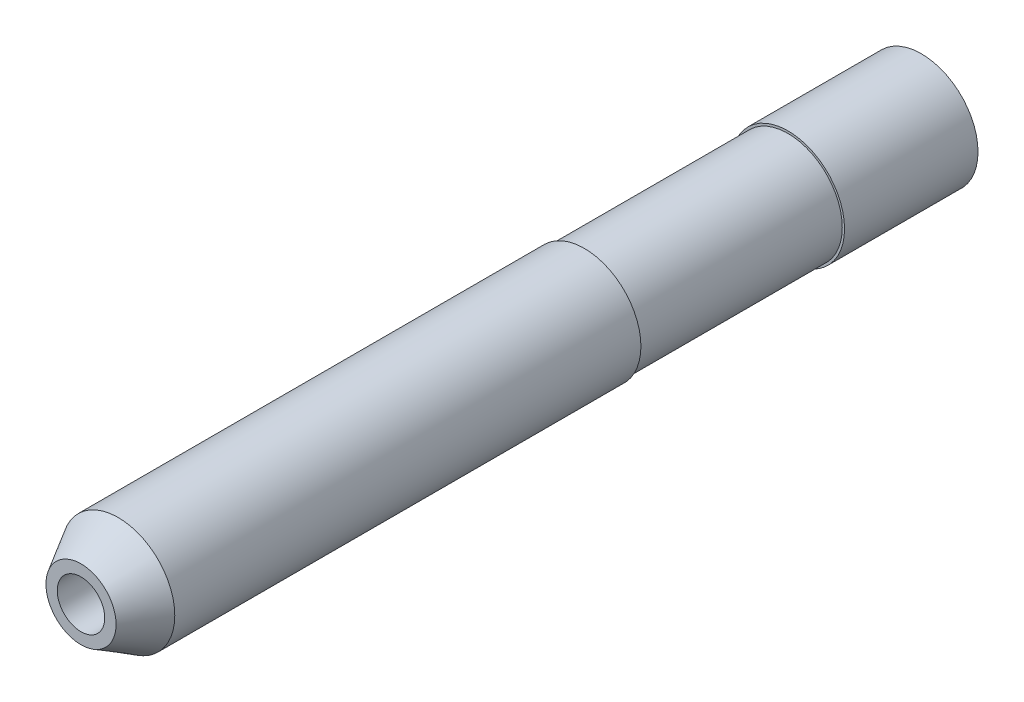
ISO-10303-21;
HEADER;
FILE_DESCRIPTION(('STEP AP214'),'2;1');
FILE_NAME('part.step','',(''),(''),'','','');
FILE_SCHEMA(('AUTOMOTIVE_DESIGN { 1 0 10303 214 1 1 1 1 }'));
ENDSEC;
DATA;
#1=APPLICATION_CONTEXT('core data for automotive mechanical design processes');
#2=APPLICATION_PROTOCOL_DEFINITION('international standard','automotive_design',2000,#1);
#3=PRODUCT_CONTEXT('',#1,'mechanical');
#4=PRODUCT('Part','Part','',(#3));
#5=PRODUCT_RELATED_PRODUCT_CATEGORY('part','',(#4));
#6=PRODUCT_DEFINITION_FORMATION('','',#4);
#7=PRODUCT_DEFINITION_CONTEXT('part definition',#1,'design');
#8=PRODUCT_DEFINITION('design','',#6,#7);
#9=PRODUCT_DEFINITION_SHAPE('','',#8);
#10=(LENGTH_UNIT() NAMED_UNIT(*) SI_UNIT(.MILLI.,.METRE.));
#11=(NAMED_UNIT(*) PLANE_ANGLE_UNIT() SI_UNIT($,.RADIAN.));
#12=(NAMED_UNIT(*) SI_UNIT($,.STERADIAN.) SOLID_ANGLE_UNIT());
#13=UNCERTAINTY_MEASURE_WITH_UNIT(LENGTH_MEASURE(1.E-05),#10,'distance_accuracy_value','');
#14=(GEOMETRIC_REPRESENTATION_CONTEXT(3) GLOBAL_UNCERTAINTY_ASSIGNED_CONTEXT((#13)) GLOBAL_UNIT_ASSIGNED_CONTEXT((#10,
#11,#12)) REPRESENTATION_CONTEXT('',''));
#15=CARTESIAN_POINT('',(0.,0.,0.));
#16=DIRECTION('',(0.,0.,1.));
#17=DIRECTION('',(1.,0.,0.));
#18=AXIS2_PLACEMENT_3D('',#15,#16,#17);
#19=CARTESIAN_POINT('',(1.11022302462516E-13,0.,1351.5));
#20=DIRECTION('',(0.,0.,-1.));
#21=DIRECTION('',(-1.,0.,0.));
#22=AXIS2_PLACEMENT_3D('',#19,#20,#21);
#23=CYLINDRICAL_SURFACE('',#22,25.);
#24=CARTESIAN_POINT('',(0.,-1.11022302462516E-13,980.));
#25=DIRECTION('',(0.,0.,1.));
#26=DIRECTION('',(1.,0.,0.));
#27=AXIS2_PLACEMENT_3D('',#24,#25,#26);
#28=CIRCLE('',#27,25.);
#29=CARTESIAN_POINT('',(25.,-1.11022302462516E-13,980.));
#30=VERTEX_POINT('',#29);
#31=EDGE_CURVE('E11',#30,#30,#28,.T.);
#32=ORIENTED_EDGE('',*,*,#31,.T.);
#33=EDGE_LOOP('',(#32));
#34=FACE_BOUND('',#33,.T.);
#35=CARTESIAN_POINT('',(1.11022302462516E-13,0.,1039.));
#36=DIRECTION('',(0.,0.,1.));
#37=DIRECTION('',(1.,0.,0.));
#38=AXIS2_PLACEMENT_3D('',#35,#36,#37);
#39=CIRCLE('',#38,25.);
#40=CARTESIAN_POINT('',(25.0000000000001,0.,1039.));
#41=VERTEX_POINT('',#40);
#42=EDGE_CURVE('E50',#41,#41,#39,.T.);
#43=ORIENTED_EDGE('',*,*,#42,.F.);
#44=EDGE_LOOP('',(#43));
#45=FACE_BOUND('',#44,.T.);
#46=ADVANCED_FACE('F16',(#34,#45),#23,.T.);
#47=CARTESIAN_POINT('',(1.11022302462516E-13,0.,1039.));
#48=DIRECTION('',(0.,0.,1.));
#49=DIRECTION('',(1.,0.,0.));
#50=AXIS2_PLACEMENT_3D('',#47,#48,#49);
#51=PLANE('',#50);
#52=CARTESIAN_POINT('',(1.11022302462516E-13,0.,1039.));
#53=DIRECTION('',(0.,0.,1.));
#54=DIRECTION('',(1.,0.,0.));
#55=AXIS2_PLACEMENT_3D('',#52,#53,#54);
#56=CIRCLE('',#55,24.);
#57=CARTESIAN_POINT('',(24.0000000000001,0.,1039.));
#58=VERTEX_POINT('',#57);
#59=EDGE_CURVE('E44',#58,#58,#56,.T.);
#60=ORIENTED_EDGE('',*,*,#59,.F.);
#61=EDGE_LOOP('',(#60));
#62=FACE_BOUND('',#61,.T.);
#63=ORIENTED_EDGE('',*,*,#42,.T.);
#64=EDGE_LOOP('',(#63));
#65=FACE_BOUND('',#64,.T.);
#66=ADVANCED_FACE('F82',(#62,#65),#51,.T.);
#67=CARTESIAN_POINT('',(0.,0.,1129.));
#68=DIRECTION('',(0.,0.,1.));
#69=DIRECTION('',(1.,0.,0.));
#70=AXIS2_PLACEMENT_3D('',#67,#68,#69);
#71=PLANE('',#70);
#72=CARTESIAN_POINT('',(0.,0.,1129.));
#73=DIRECTION('',(0.,0.,1.));
#74=DIRECTION('',(1.,0.,0.));
#75=AXIS2_PLACEMENT_3D('',#72,#73,#74);
#76=CIRCLE('',#75,24.);
#77=CARTESIAN_POINT('',(24.,0.,1129.));
#78=VERTEX_POINT('',#77);
#79=EDGE_CURVE('E39',#78,#78,#76,.T.);
#80=ORIENTED_EDGE('',*,*,#79,.T.);
#81=EDGE_LOOP('',(#80));
#82=FACE_BOUND('',#81,.T.);
#83=CARTESIAN_POINT('',(0.,0.,1129.));
#84=DIRECTION('',(0.,0.,1.));
#85=DIRECTION('',(1.,0.,0.));
#86=AXIS2_PLACEMENT_3D('',#83,#84,#85);
#87=CIRCLE('',#86,25.);
#88=CARTESIAN_POINT('',(25.,0.,1129.));
#89=VERTEX_POINT('',#88);
#90=EDGE_CURVE('E47',#89,#89,#87,.T.);
#91=ORIENTED_EDGE('',*,*,#90,.F.);
#92=EDGE_LOOP('',(#91));
#93=FACE_BOUND('',#92,.T.);
#94=ADVANCED_FACE('F76',(#82,#93),#71,.F.);
#95=CARTESIAN_POINT('',(1.11022302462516E-13,0.,1039.));
#96=DIRECTION('',(0.,0.,1.));
#97=DIRECTION('',(1.,0.,0.));
#98=AXIS2_PLACEMENT_3D('',#95,#96,#97);
#99=CYLINDRICAL_SURFACE('',#98,24.);
#100=ORIENTED_EDGE('',*,*,#59,.T.);
#101=EDGE_LOOP('',(#100));
#102=FACE_BOUND('',#101,.T.);
#103=ORIENTED_EDGE('',*,*,#79,.F.);
#104=EDGE_LOOP('',(#103));
#105=FACE_BOUND('',#104,.T.);
#106=ADVANCED_FACE('F68',(#102,#105),#99,.T.);
#107=CARTESIAN_POINT('',(1.11022302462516E-13,0.,1351.5));
#108=DIRECTION('',(0.,0.,1.));
#109=DIRECTION('',(1.,0.,0.));
#110=AXIS2_PLACEMENT_3D('',#107,#108,#109);
#111=PLANE('',#110);
#112=CARTESIAN_POINT('',(1.11022302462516E-13,0.,1351.5));
#113=DIRECTION('',(0.,0.,1.));
#114=DIRECTION('',(1.,0.,0.));
#115=AXIS2_PLACEMENT_3D('',#112,#113,#114);
#116=CIRCLE('',#115,10.5);
#117=CARTESIAN_POINT('',(10.5000000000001,0.,1351.5));
#118=VERTEX_POINT('',#117);
#119=EDGE_CURVE('E36',#118,#118,#116,.T.);
#120=ORIENTED_EDGE('',*,*,#119,.F.);
#121=EDGE_LOOP('',(#120));
#122=FACE_BOUND('',#121,.T.);
#123=CARTESIAN_POINT('',(1.11022302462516E-13,0.,1351.5));
#124=DIRECTION('',(0.,0.,1.));
#125=DIRECTION('',(1.,0.,0.));
#126=AXIS2_PLACEMENT_3D('',#123,#124,#125);
#127=CIRCLE('',#126,15.5000003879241);
#128=CARTESIAN_POINT('',(15.5000003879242,0.,1351.5));
#129=VERTEX_POINT('',#128);
#130=EDGE_CURVE('E53',#129,#129,#127,.T.);
#131=ORIENTED_EDGE('',*,*,#130,.T.);
#132=EDGE_LOOP('',(#131));
#133=FACE_BOUND('',#132,.T.);
#134=ADVANCED_FACE('F66',(#122,#133),#111,.T.);
#135=CARTESIAN_POINT('',(0.,0.,1335.045518));
#136=DIRECTION('',(0.,0.,1.));
#137=DIRECTION('',(1.,0.,0.));
#138=AXIS2_PLACEMENT_3D('',#135,#136,#137);
#139=CIRCLE('',#138,25.);
#140=CARTESIAN_POINT('',(25.,0.,1335.045518));
#141=VERTEX_POINT('',#140);
#142=EDGE_CURVE('E23',#141,#141,#139,.F.);
#143=ORIENTED_EDGE('',*,*,#142,.T.);
#144=EDGE_LOOP('',(#143));
#145=FACE_BOUND('',#144,.T.);
#146=ORIENTED_EDGE('',*,*,#90,.T.);
#147=EDGE_LOOP('',(#146));
#148=FACE_BOUND('',#147,.T.);
#149=ADVANCED_FACE('F18',(#145,#148),#23,.T.);
#150=CARTESIAN_POINT('',(1.11022302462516E-13,0.,1351.5));
#151=DIRECTION('',(0.,0.,-1.));
#152=DIRECTION('',(-1.,0.,0.));
#153=AXIS2_PLACEMENT_3D('',#150,#151,#152);
#154=CONICAL_SURFACE('',#153,15.5000003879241,0.523598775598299);
#155=ORIENTED_EDGE('',*,*,#142,.F.);
#156=EDGE_LOOP('',(#155));
#157=FACE_BOUND('',#156,.T.);
#158=ORIENTED_EDGE('',*,*,#130,.F.);
#159=EDGE_LOOP('',(#158));
#160=FACE_BOUND('',#159,.T.);
#161=ADVANCED_FACE('F60',(#157,#160),#154,.T.);
#162=CARTESIAN_POINT('',(1.11022302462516E-13,0.,1351.5));
#163=DIRECTION('',(0.,0.,1.));
#164=DIRECTION('',(1.,0.,0.));
#165=AXIS2_PLACEMENT_3D('',#162,#163,#164);
#166=CYLINDRICAL_SURFACE('',#165,10.5);
#167=CARTESIAN_POINT('',(0.,0.,1291.5));
#168=DIRECTION('',(0.,0.,1.));
#169=DIRECTION('',(1.,0.,0.));
#170=AXIS2_PLACEMENT_3D('',#167,#168,#169);
#171=CIRCLE('',#170,10.5);
#172=CARTESIAN_POINT('',(10.5000000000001,0.,1291.5));
#173=VERTEX_POINT('',#172);
#174=EDGE_CURVE('E34',#173,#173,#171,.T.);
#175=ORIENTED_EDGE('',*,*,#174,.F.);
#176=EDGE_LOOP('',(#175));
#177=FACE_BOUND('',#176,.T.);
#178=ORIENTED_EDGE('',*,*,#119,.T.);
#179=EDGE_LOOP('',(#178));
#180=FACE_BOUND('',#179,.T.);
#181=ADVANCED_FACE('F30',(#177,#180),#166,.F.);
#182=CARTESIAN_POINT('',(0.,0.,1291.5));
#183=DIRECTION('',(0.,0.,1.));
#184=DIRECTION('',(1.,0.,0.));
#185=AXIS2_PLACEMENT_3D('',#182,#183,#184);
#186=CONICAL_SURFACE('',#185,10.5,1.0471975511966);
#187=CARTESIAN_POINT('',(0.,0.,1285.43782217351));
#188=VERTEX_POINT('',#187);
#189=VERTEX_LOOP('',#188);
#190=FACE_BOUND('',#189,.T.);
#191=ORIENTED_EDGE('',*,*,#174,.T.);
#192=EDGE_LOOP('',(#191));
#193=FACE_BOUND('',#192,.T.);
#194=ADVANCED_FACE('F26',(#190,#193),#186,.F.);
#195=CARTESIAN_POINT('',(-182.937242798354,-25.,980.));
#196=DIRECTION('',(0.,0.,1.));
#197=DIRECTION('',(1.,0.,0.));
#198=AXIS2_PLACEMENT_3D('',#195,#196,#197);
#199=PLANE('',#198);
#200=ORIENTED_EDGE('',*,*,#31,.F.);
#201=EDGE_LOOP('',(#200));
#202=FACE_BOUND('',#201,.T.);
#203=ADVANCED_FACE('F29',(#202),#199,.F.);
#204=CLOSED_SHELL('',(#46,#66,#94,#106,#134,#149,#161,#181,#194,#203));
#205=MANIFOLD_SOLID_BREP('B1',#204);
#206=ADVANCED_BREP_SHAPE_REPRESENTATION('',(#18,#205),#14);
#207=SHAPE_DEFINITION_REPRESENTATION(#9,#206);
ENDSEC;
END-ISO-10303-21;
